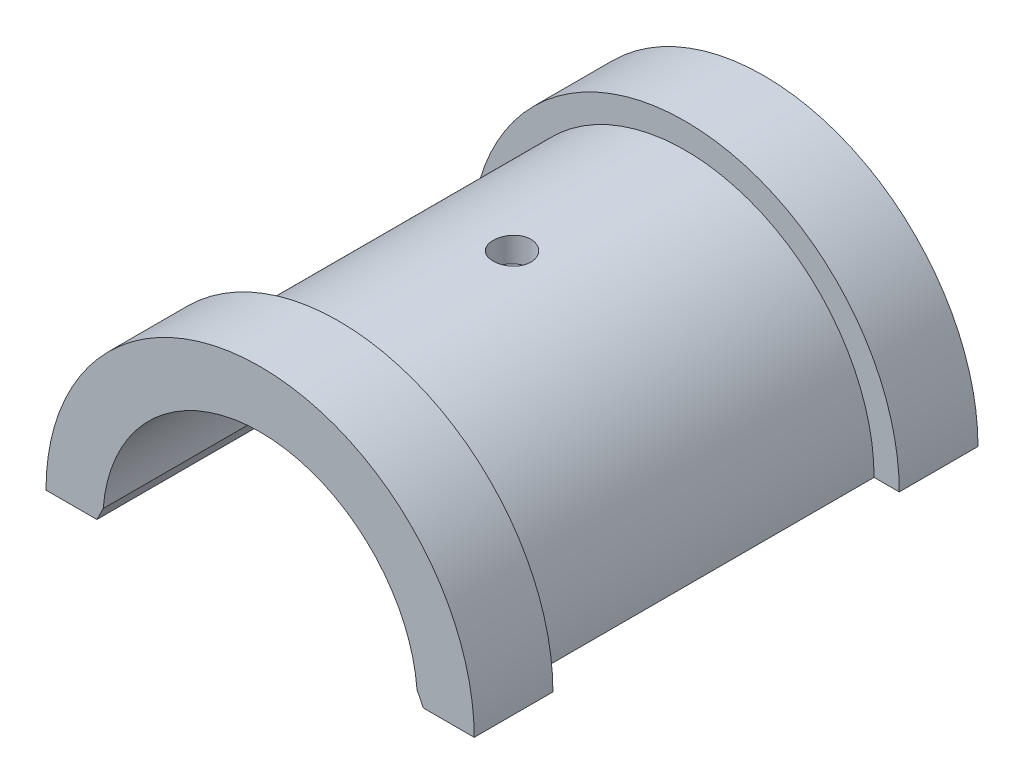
from build123d import *

# Parameters (mm, degrees)
EXTRUDE_1_DEPTH     = 40
EXTRUDE_2_DEPTH     = 12.5
EXTRUDE_START       = -12.5
EXTRUDE_3_DEPTH     = 12.5
CUT_EXTRUDE_2_DEPTH = 136.543350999
SKETCH_7_W          = 3
SKETCH_7_H          = 5


with BuildPart() as part:
    # Sketch 1 → Extrude 1 (new, symmetric)
    with BuildSketch(Plane.XY):
        with BuildLine():
            Line((-30, 70), (-25, 70))
            ThreePointArc((-25, 70), (0, 95), (25, 70))
            Line((25, 70), (30, 70))
            ThreePointArc((30, 70), (0, 100), (-30, 70))
        make_face()
    extrude(amount=EXTRUDE_1_DEPTH, both=True)

    # Sketch 3 → Extrude 2 (add)
    with BuildSketch(Plane.XY.offset(40)):
        with BuildLine():
            Line((-25, 70), (-34, 70))
            ThreePointArc((-34, 70), (0, 104), (34, 70))
            Line((34, 70), (25, 70))
            ThreePointArc((25, 70), (0, 95), (-25, 70))
        make_face()
    extrude(amount=-EXTRUDE_2_DEPTH)

    # Sketch 4 → Extrude 3 (add)
    with BuildSketch(Plane(origin=(0, 0, -40), x_dir=(-1, 0, 0), z_dir=(0, 0, -1)).offset(EXTRUDE_START)):
        with BuildLine():
            Line((34, 70), (25, 70))
            ThreePointArc((25, 70), (0, 95), (-25, 70))
            Line((-25, 70), (-34, 70))
            ThreePointArc((-34, 70), (0, 104), (34, 70))
        make_face()
    extrude(amount=EXTRUDE_3_DEPTH)

    # Sketch 6 → Cut-Extrude 2 (cut, through all)
    with BuildSketch(Plane.XY.offset(40)):
        Polygon((-25.919871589, 70), (-24.919871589, 70), (-24.919871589, 72), align=None)
    cut_extrude_2 = extrude(amount=-CUT_EXTRUDE_2_DEPTH, mode=Mode.SUBTRACT)

    # Mirror 1: Cut-Extrude 2 across plane
    add(cut_extrude_2.mirror(Plane(origin=(0, 0, 0), x_dir=(0, 0, 1), z_dir=(1, 0, 0))), mode=Mode.SUBTRACT)

    # Sketch 7 → Cut-Revolve 1 (revolve, cut)
    with BuildSketch(Plane.XY):
        with Locations((-1.5, 98.5)):
            Rectangle(SKETCH_7_W, SKETCH_7_H)
    revolve(axis=Axis((0, 120.528811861, 0), (0, -1, 0)), mode=Mode.SUBTRACT)


solid = part.part
